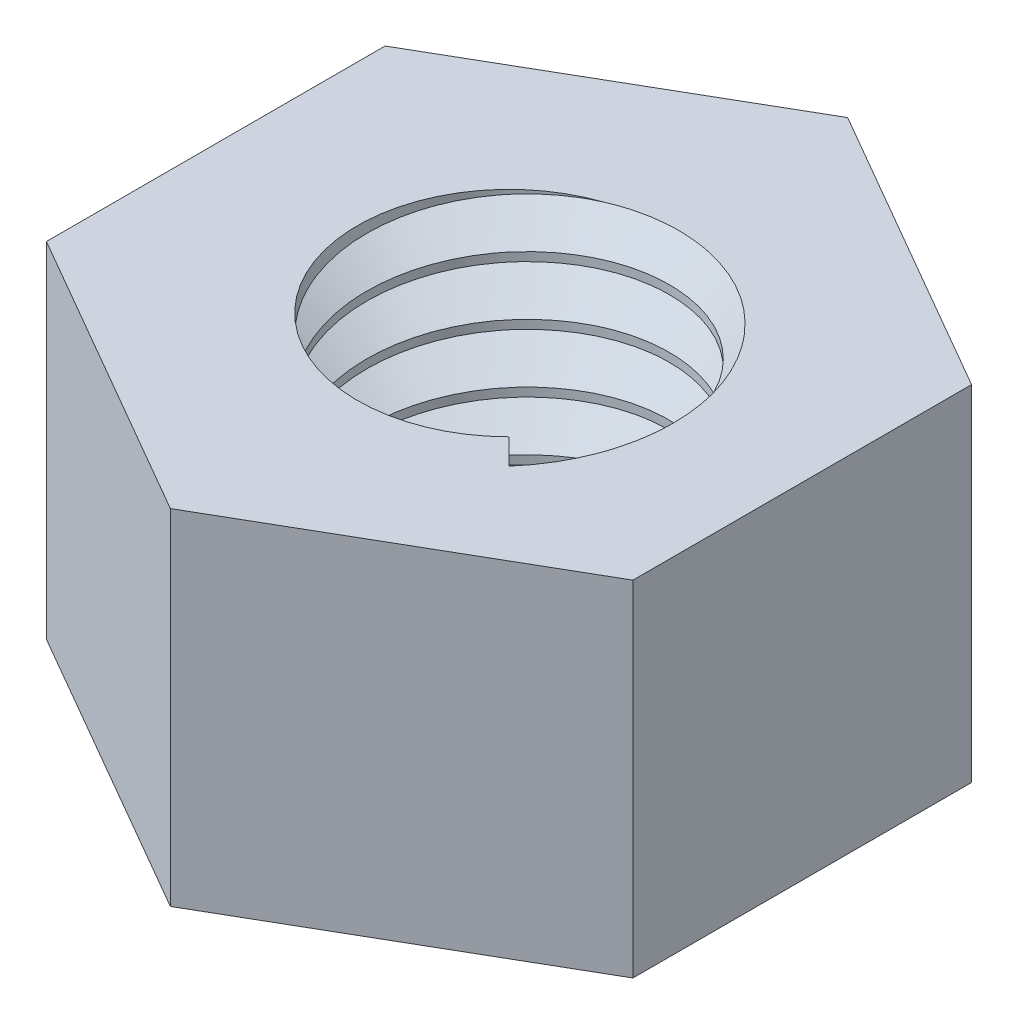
from build123d import *

# Parameters (mm, degrees)
HEXAGONO_DEPTH      = 4.7
TALADRO_PROFILE_R   = 2.067
ROSCA_M5X0_8_PITCH  = 0.8
ROSCA_M5X0_8_HEIGHT = 4.7
ROSCA_M5X0_8_RADIUS = 2.06696


with BuildPart() as part:
    # Sk_Hexagono → Hexagono (new body)
    with BuildSketch(Plane(origin=(0, 0, 0), x_dir=(1, 0, 0), z_dir=(0, 1, 0))):
        Polygon((4, -2.309401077), (0, -4.618802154), (-4, -2.309401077), (-4, 2.309401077), (0, 4.618802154), (4, 2.309401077), align=None)
    extrude(amount=HEXAGONO_DEPTH)

    # Taladro: sweep along a curve in space
    with BuildLine() as taladro_path:
        Line((0, -1, 0), (0, 5.7, 0))
    # Taladro profile (on start of the path) → Taladro (sweep, cut)
    with BuildSketch(Plane.ZX.offset(-1)):
        Circle(TALADRO_PROFILE_R)
    sweep(path=taladro_path.line, mode=Mode.SUBTRACT)

    # Rosca_M5x0_8: sweep along a helix
    with BuildLine() as rosca_m5x0_8_path:
        Helix(ROSCA_M5X0_8_PITCH, ROSCA_M5X0_8_HEIGHT, ROSCA_M5X0_8_RADIUS, center=(0, 0, 0), direction=(0, 1, 0), lefthand=True)
    # Sk_Perfil_rosca → Rosca_M5x0_8 (sweep, cut)
    with BuildSketch(Plane(origin=(0, 0, 0), x_dir=(0, 0, -1), z_dir=(1, 0, 0))):
        Polygon((-1.86696, -0.48), (-2.55768, 0), (-1.86696, 0.48), align=None)
    sweep(path=rosca_m5x0_8_path.line, is_frenet=True, mode=Mode.SUBTRACT)


solid = part.part
